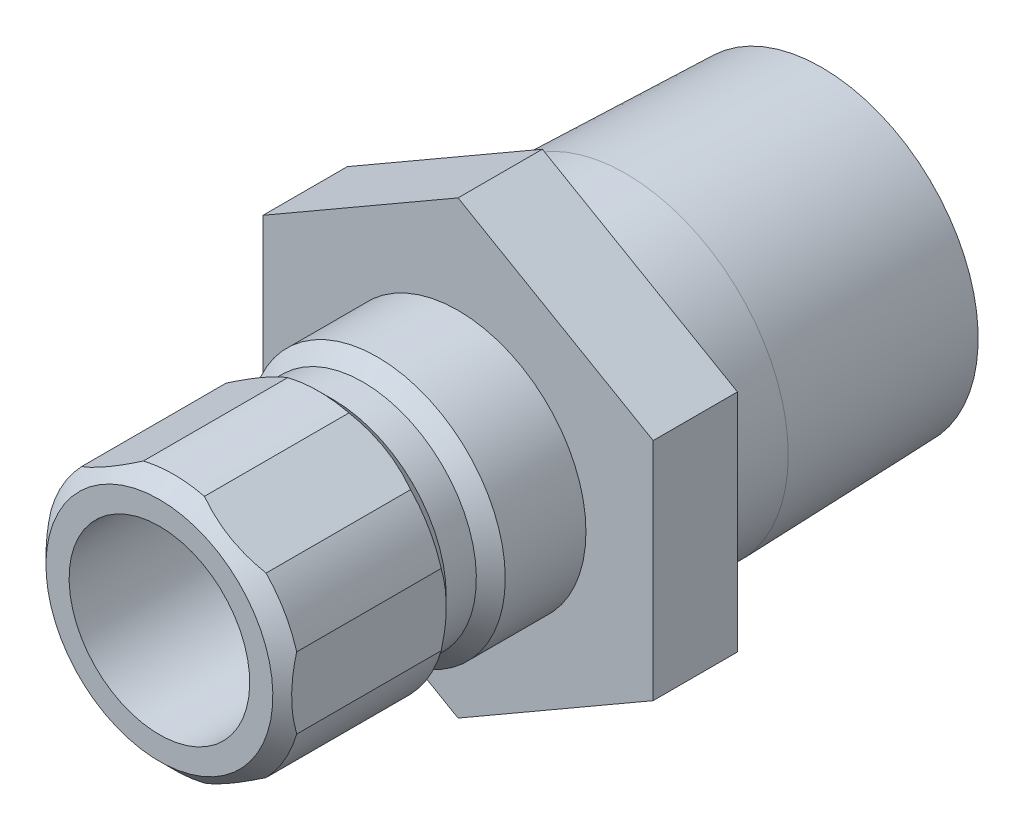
ISO-10303-21;
HEADER;
FILE_DESCRIPTION(('STEP AP214'),'2;1');
FILE_NAME('part.step','',(''),(''),'','','');
FILE_SCHEMA(('AUTOMOTIVE_DESIGN { 1 0 10303 214 1 1 1 1 }'));
ENDSEC;
DATA;
#1=APPLICATION_CONTEXT('core data for automotive mechanical design processes');
#2=APPLICATION_PROTOCOL_DEFINITION('international standard','automotive_design',2000,#1);
#3=PRODUCT_CONTEXT('',#1,'mechanical');
#4=PRODUCT('Part','Part','',(#3));
#5=PRODUCT_RELATED_PRODUCT_CATEGORY('part','',(#4));
#6=PRODUCT_DEFINITION_FORMATION('','',#4);
#7=PRODUCT_DEFINITION_CONTEXT('part definition',#1,'design');
#8=PRODUCT_DEFINITION('design','',#6,#7);
#9=PRODUCT_DEFINITION_SHAPE('','',#8);
#10=(LENGTH_UNIT() NAMED_UNIT(*) SI_UNIT(.MILLI.,.METRE.));
#11=(NAMED_UNIT(*) PLANE_ANGLE_UNIT() SI_UNIT($,.RADIAN.));
#12=(NAMED_UNIT(*) SI_UNIT($,.STERADIAN.) SOLID_ANGLE_UNIT());
#13=UNCERTAINTY_MEASURE_WITH_UNIT(LENGTH_MEASURE(1.E-05),#10,'distance_accuracy_value','');
#14=(GEOMETRIC_REPRESENTATION_CONTEXT(3) GLOBAL_UNCERTAINTY_ASSIGNED_CONTEXT((#13)) GLOBAL_UNIT_ASSIGNED_CONTEXT((#10,
#11,#12)) REPRESENTATION_CONTEXT('',''));
#15=CARTESIAN_POINT('',(0.,0.,0.));
#16=DIRECTION('',(0.,0.,1.));
#17=DIRECTION('',(1.,0.,0.));
#18=AXIS2_PLACEMENT_3D('',#15,#16,#17);
#19=CARTESIAN_POINT('',(0.,0.,0.));
#20=DIRECTION('',(0.,0.,-1.));
#21=DIRECTION('',(0.,1.,0.));
#22=AXIS2_PLACEMENT_3D('',#19,#20,#21);
#23=CYLINDRICAL_SURFACE('',#22,6.7437);
#24=DIRECTION('',(0.,0.,-1.));
#25=VECTOR('',#24,1.);
#26=CARTESIAN_POINT('',(-4.8646828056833,4.67036945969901,0.));
#27=LINE('',#26,#25);
#28=CARTESIAN_POINT('',(-4.86468280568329,4.67036945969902,7.36599999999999));
#29=VERTEX_POINT('',#28);
#30=CARTESIAN_POINT('',(-4.8646828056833,4.67036945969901,14.986));
#31=VERTEX_POINT('',#30);
#32=EDGE_CURVE('E659',#29,#31,#27,.F.);
#33=ORIENTED_EDGE('',*,*,#32,.F.);
#34=CARTESIAN_POINT('',(0.,0.,7.36599999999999));
#35=DIRECTION('',(0.,0.,-1.));
#36=DIRECTION('',(0.,1.,0.));
#37=AXIS2_PLACEMENT_3D('',#34,#35,#36);
#38=CIRCLE('',#37,6.7437);
#39=CARTESIAN_POINT('',(-6.477,1.87775416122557,7.36599999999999));
#40=VERTEX_POINT('',#39);
#41=EDGE_CURVE('E188',#40,#29,#38,.T.);
#42=ORIENTED_EDGE('',*,*,#41,.F.);
#43=DIRECTION('',(0.,0.,-1.));
#44=VECTOR('',#43,1.);
#45=CARTESIAN_POINT('',(-6.477,1.87775416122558,0.));
#46=LINE('',#45,#44);
#47=CARTESIAN_POINT('',(-6.477,1.87775416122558,14.986));
#48=VERTEX_POINT('',#47);
#49=EDGE_CURVE('E61',#48,#40,#46,.T.);
#50=ORIENTED_EDGE('',*,*,#49,.F.);
#51=CARTESIAN_POINT('',(0.,0.,14.986));
#52=DIRECTION('',(0.,0.,-1.));
#53=DIRECTION('',(0.,1.,0.));
#54=AXIS2_PLACEMENT_3D('',#51,#52,#53);
#55=CIRCLE('',#54,6.7437);
#56=EDGE_CURVE('E199',#48,#31,#55,.T.);
#57=ORIENTED_EDGE('',*,*,#56,.T.);
#58=EDGE_LOOP('',(#33,#42,#50,#57));
#59=FACE_BOUND('',#58,.T.);
#60=ADVANCED_FACE('F34',(#59),#23,.T.);
#61=DIRECTION('',(0.,0.,-1.));
#62=VECTOR('',#61,1.);
#63=CARTESIAN_POINT('',(-6.477,-1.87775416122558,0.));
#64=LINE('',#63,#62);
#65=CARTESIAN_POINT('',(-6.477,-1.87775416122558,7.36599999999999));
#66=VERTEX_POINT('',#65);
#67=CARTESIAN_POINT('',(-6.477,-1.87775416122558,14.986));
#68=VERTEX_POINT('',#67);
#69=EDGE_CURVE('E219',#66,#68,#64,.F.);
#70=ORIENTED_EDGE('',*,*,#69,.F.);
#71=CARTESIAN_POINT('',(-4.86468280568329,-4.67036945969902,7.36599999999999));
#72=VERTEX_POINT('',#71);
#73=EDGE_CURVE('E192',#72,#66,#38,.T.);
#74=ORIENTED_EDGE('',*,*,#73,.F.);
#75=DIRECTION('',(0.,0.,-1.));
#76=VECTOR('',#75,1.);
#77=CARTESIAN_POINT('',(-4.86468280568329,-4.67036945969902,0.));
#78=LINE('',#77,#76);
#79=CARTESIAN_POINT('',(-4.86468280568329,-4.67036945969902,14.986));
#80=VERTEX_POINT('',#79);
#81=EDGE_CURVE('E217',#80,#72,#78,.T.);
#82=ORIENTED_EDGE('',*,*,#81,.F.);
#83=EDGE_CURVE('E220',#80,#68,#55,.T.);
#84=ORIENTED_EDGE('',*,*,#83,.T.);
#85=EDGE_LOOP('',(#70,#74,#82,#84));
#86=FACE_BOUND('',#85,.T.);
#87=ADVANCED_FACE('F215',(#86),#23,.T.);
#88=DIRECTION('',(0.,0.,-1.));
#89=VECTOR('',#88,1.);
#90=CARTESIAN_POINT('',(-1.61231719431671,-6.5481236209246,0.));
#91=LINE('',#90,#89);
#92=CARTESIAN_POINT('',(-1.61231719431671,-6.5481236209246,7.36599999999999));
#93=VERTEX_POINT('',#92);
#94=CARTESIAN_POINT('',(-1.61231719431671,-6.5481236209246,14.986));
#95=VERTEX_POINT('',#94);
#96=EDGE_CURVE('E298',#93,#95,#91,.F.);
#97=ORIENTED_EDGE('',*,*,#96,.F.);
#98=CARTESIAN_POINT('',(1.61231719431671,-6.5481236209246,7.36599999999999));
#99=VERTEX_POINT('',#98);
#100=EDGE_CURVE('E202',#99,#93,#38,.T.);
#101=ORIENTED_EDGE('',*,*,#100,.F.);
#102=DIRECTION('',(0.,0.,-1.));
#103=VECTOR('',#102,1.);
#104=CARTESIAN_POINT('',(1.61231719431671,-6.5481236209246,0.));
#105=LINE('',#104,#103);
#106=CARTESIAN_POINT('',(1.61231719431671,-6.5481236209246,14.986));
#107=VERTEX_POINT('',#106);
#108=EDGE_CURVE('E315',#107,#99,#105,.T.);
#109=ORIENTED_EDGE('',*,*,#108,.F.);
#110=EDGE_CURVE('E311',#107,#95,#55,.T.);
#111=ORIENTED_EDGE('',*,*,#110,.T.);
#112=EDGE_LOOP('',(#97,#101,#109,#111));
#113=FACE_BOUND('',#112,.T.);
#114=ADVANCED_FACE('F314',(#113),#23,.T.);
#115=DIRECTION('',(0.,0.,-1.));
#116=VECTOR('',#115,1.);
#117=CARTESIAN_POINT('',(4.8646828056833,-4.67036945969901,0.));
#118=LINE('',#117,#116);
#119=CARTESIAN_POINT('',(4.8646828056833,-4.67036945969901,7.36599999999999));
#120=VERTEX_POINT('',#119);
#121=CARTESIAN_POINT('',(4.8646828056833,-4.67036945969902,14.986));
#122=VERTEX_POINT('',#121);
#123=EDGE_CURVE('E295',#120,#122,#118,.F.);
#124=ORIENTED_EDGE('',*,*,#123,.F.);
#125=CARTESIAN_POINT('',(6.477,-1.87775416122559,7.36599999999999));
#126=VERTEX_POINT('',#125);
#127=EDGE_CURVE('E197',#126,#120,#38,.T.);
#128=ORIENTED_EDGE('',*,*,#127,.F.);
#129=DIRECTION('',(0.,0.,-1.));
#130=VECTOR('',#129,1.);
#131=CARTESIAN_POINT('',(6.477,-1.87775416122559,0.));
#132=LINE('',#131,#130);
#133=CARTESIAN_POINT('',(6.477,-1.8777541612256,14.986));
#134=VERTEX_POINT('',#133);
#135=EDGE_CURVE('E406',#134,#126,#132,.T.);
#136=ORIENTED_EDGE('',*,*,#135,.F.);
#137=EDGE_CURVE('E316',#134,#122,#55,.T.);
#138=ORIENTED_EDGE('',*,*,#137,.T.);
#139=EDGE_LOOP('',(#124,#128,#136,#138));
#140=FACE_BOUND('',#139,.T.);
#141=ADVANCED_FACE('F391',(#140),#23,.T.);
#142=DIRECTION('',(0.,0.,-1.));
#143=VECTOR('',#142,1.);
#144=CARTESIAN_POINT('',(6.477,1.87775416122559,0.));
#145=LINE('',#144,#143);
#146=CARTESIAN_POINT('',(6.477,1.87775416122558,7.36599999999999));
#147=VERTEX_POINT('',#146);
#148=CARTESIAN_POINT('',(6.477,1.87775416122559,14.986));
#149=VERTEX_POINT('',#148);
#150=EDGE_CURVE('E401',#147,#149,#145,.F.);
#151=ORIENTED_EDGE('',*,*,#150,.F.);
#152=CARTESIAN_POINT('',(4.86468280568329,4.67036945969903,7.36599999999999));
#153=VERTEX_POINT('',#152);
#154=EDGE_CURVE('E191',#153,#147,#38,.T.);
#155=ORIENTED_EDGE('',*,*,#154,.F.);
#156=DIRECTION('',(0.,0.,-1.));
#157=VECTOR('',#156,1.);
#158=CARTESIAN_POINT('',(4.86468280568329,4.67036945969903,0.));
#159=LINE('',#158,#157);
#160=CARTESIAN_POINT('',(4.86468280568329,4.67036945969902,14.986));
#161=VERTEX_POINT('',#160);
#162=EDGE_CURVE('E168',#161,#153,#159,.T.);
#163=ORIENTED_EDGE('',*,*,#162,.F.);
#164=EDGE_CURVE('E200',#161,#149,#55,.T.);
#165=ORIENTED_EDGE('',*,*,#164,.T.);
#166=EDGE_LOOP('',(#151,#155,#163,#165));
#167=FACE_BOUND('',#166,.T.);
#168=ADVANCED_FACE('F385',(#167),#23,.T.);
#169=CARTESIAN_POINT('',(0.,0.,0.));
#170=DIRECTION('',(0.,0.,-1.));
#171=DIRECTION('',(0.,1.,0.));
#172=AXIS2_PLACEMENT_3D('',#169,#170,#171);
#173=CYLINDRICAL_SURFACE('',#172,4.7625);
#174=CARTESIAN_POINT('',(0.,0.,15.748));
#175=DIRECTION('',(0.,0.,-1.));
#176=DIRECTION('',(0.,1.,0.));
#177=AXIS2_PLACEMENT_3D('',#174,#175,#176);
#178=CIRCLE('',#177,4.7625);
#179=CARTESIAN_POINT('',(0.,4.7625,15.748));
#180=VERTEX_POINT('',#179);
#181=EDGE_CURVE('E174',#180,#180,#178,.T.);
#182=ORIENTED_EDGE('',*,*,#181,.F.);
#183=EDGE_LOOP('',(#182));
#184=FACE_BOUND('',#183,.T.);
#185=CARTESIAN_POINT('',(0.,0.,-4.445));
#186=DIRECTION('',(0.,0.,1.));
#187=DIRECTION('',(1.,0.,0.));
#188=AXIS2_PLACEMENT_3D('',#185,#186,#187);
#189=CIRCLE('',#188,4.7625);
#190=CARTESIAN_POINT('',(4.7625,0.,-4.445));
#191=VERTEX_POINT('',#190);
#192=EDGE_CURVE('E483',#191,#191,#189,.T.);
#193=ORIENTED_EDGE('',*,*,#192,.F.);
#194=EDGE_LOOP('',(#193));
#195=FACE_BOUND('',#194,.T.);
#196=ADVANCED_FACE('F36',(#184,#195),#173,.F.);
#197=CARTESIAN_POINT('',(0.,4.7625,15.748));
#198=DIRECTION('',(0.,0.,1.));
#199=DIRECTION('',(0.,-1.,0.));
#200=AXIS2_PLACEMENT_3D('',#197,#198,#199);
#201=PLANE('',#200);
#202=ORIENTED_EDGE('',*,*,#181,.T.);
#203=EDGE_LOOP('',(#202));
#204=FACE_BOUND('',#203,.T.);
#205=CARTESIAN_POINT('',(0.,0.,15.748));
#206=DIRECTION('',(0.,0.,-1.));
#207=DIRECTION('',(0.,1.,0.));
#208=AXIS2_PLACEMENT_3D('',#205,#206,#207);
#209=CIRCLE('',#208,5.9817);
#210=CARTESIAN_POINT('',(0.,5.9817,15.748));
#211=VERTEX_POINT('',#210);
#212=EDGE_CURVE('E319',#211,#211,#209,.T.);
#213=ORIENTED_EDGE('',*,*,#212,.F.);
#214=EDGE_LOOP('',(#213));
#215=FACE_BOUND('',#214,.T.);
#216=ADVANCED_FACE('F389',(#204,#215),#201,.T.);
#217=CARTESIAN_POINT('',(0.,0.,14.986));
#218=DIRECTION('',(0.,0.,-1.));
#219=DIRECTION('',(0.,1.,0.));
#220=AXIS2_PLACEMENT_3D('',#217,#218,#219);
#221=CONICAL_SURFACE('',#220,6.7437,0.785398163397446);
#222=CARTESIAN_POINT('',(-4.86530473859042,4.67001038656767,14.9858));
#223=CARTESIAN_POINT('',(-4.72486305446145,4.75109443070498,15.0310202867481));
#224=CARTESIAN_POINT('',(-4.58312979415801,4.83292416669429,15.0711660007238));
#225=CARTESIAN_POINT('',(-4.29751110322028,4.99782619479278,15.1402365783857));
#226=CARTESIAN_POINT('',(-4.1536239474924,5.0808994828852,15.1691518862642));
#227=CARTESIAN_POINT('',(-3.86733938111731,5.2461859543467,15.2141425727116));
#228=CARTESIAN_POINT('',(-3.72497207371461,5.32838175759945,15.2304694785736));
#229=CARTESIAN_POINT('',(-3.43963286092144,5.49312242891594,15.2506210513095));
#230=CARTESIAN_POINT('',(-3.29666126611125,5.57566711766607,15.2544515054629));
#231=CARTESIAN_POINT('',(-3.02472390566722,5.73267022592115,15.2497120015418));
#232=CARTESIAN_POINT('',(-2.89574173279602,5.807138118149,15.2423062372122));
#233=CARTESIAN_POINT('',(-2.63846984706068,5.95567411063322,15.2174303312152));
#234=CARTESIAN_POINT('',(-2.51018036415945,6.02974207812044,15.1999570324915));
#235=CARTESIAN_POINT('',(-2.25244237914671,6.17854717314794,15.1550584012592));
#236=CARTESIAN_POINT('',(-2.1230180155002,6.25327036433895,15.1274506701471));
#237=CARTESIAN_POINT('',(-1.86594955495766,6.40168890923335,15.0631944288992));
#238=CARTESIAN_POINT('',(-1.73830430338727,6.47538492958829,15.026552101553));
#239=CARTESIAN_POINT('',(-1.61169526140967,6.5484826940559,14.9858));
#240=B_SPLINE_CURVE_WITH_KNOTS('',3,(#222,#223,#224,#225,#226,#227,#228,#229,#230,#231,#232,
#233,#234,#235,#236,#237,#238,#239),.UNSPECIFIED.,.F.,.F.,(4,2,2,2,2,2,2,2,4),(0.,
0.505093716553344,1.01061627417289,1.50575564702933,2.00066568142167,2.4476800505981,
2.89483467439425,3.35046683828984,3.80578805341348),.UNSPECIFIED.);
#241=CARTESIAN_POINT('',(-1.61231719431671,6.5481236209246,14.986));
#242=VERTEX_POINT('',#241);
#243=EDGE_CURVE('E488',#31,#242,#240,.T.);
#244=ORIENTED_EDGE('',*,*,#243,.F.);
#245=ORIENTED_EDGE('',*,*,#56,.F.);
#246=CARTESIAN_POINT('',(-6.477,-7.31595245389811,11.9585849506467));
#247=CARTESIAN_POINT('',(-6.477,-7.1371619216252,12.09242068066));
#248=CARTESIAN_POINT('',(-6.477,-6.95735466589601,12.2249205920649));
#249=CARTESIAN_POINT('',(-6.477,-6.59531185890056,12.4866559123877));
#250=CARTESIAN_POINT('',(-6.477,-6.41307569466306,12.6158904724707));
#251=CARTESIAN_POINT('',(-6.477,-6.04444818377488,12.8714195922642));
#252=CARTESIAN_POINT('',(-6.477,-5.85803557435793,12.9976835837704));
#253=CARTESIAN_POINT('',(-6.477,-5.48202253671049,13.245356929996));
#254=CARTESIAN_POINT('',(-6.477,-5.29242233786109,13.3667666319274));
#255=CARTESIAN_POINT('',(-6.477,-4.8990824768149,13.6101330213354));
#256=CARTESIAN_POINT('',(-6.477,-4.69513615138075,13.7317573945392));
#257=CARTESIAN_POINT('',(-6.477,-4.2824994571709,13.9668032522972));
#258=CARTESIAN_POINT('',(-6.477,-4.07380836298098,14.0802234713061));
#259=CARTESIAN_POINT('',(-6.477,-3.65173370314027,14.2964010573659));
#260=CARTESIAN_POINT('',(-6.477,-3.43836632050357,14.3991897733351));
#261=CARTESIAN_POINT('',(-6.477,-3.00590599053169,14.59180459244));
#262=CARTESIAN_POINT('',(-6.477,-2.78681563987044,14.6816364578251));
#263=CARTESIAN_POINT('',(-6.477,-2.35869152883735,14.8392509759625));
#264=CARTESIAN_POINT('',(-6.477,-2.15007621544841,14.9081583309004));
#265=CARTESIAN_POINT('',(-6.477,-1.72794730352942,15.029215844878));
#266=CARTESIAN_POINT('',(-6.477,-1.51443335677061,15.0813648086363));
#267=CARTESIAN_POINT('',(-6.477,-1.08726616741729,15.1653541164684));
#268=CARTESIAN_POINT('',(-6.477,-0.873680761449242,15.1975339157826));
#269=CARTESIAN_POINT('',(-6.477,-0.444382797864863,15.2409825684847));
#270=CARTESIAN_POINT('',(-6.477,-0.228670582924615,15.2522547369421));
#271=CARTESIAN_POINT('',(-6.477,0.195590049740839,15.2531049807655));
#272=CARTESIAN_POINT('',(-6.477,0.40413733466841,15.2433943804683));
#273=CARTESIAN_POINT('',(-6.477,0.819375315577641,15.2043531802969));
#274=CARTESIAN_POINT('',(-6.477,1.026065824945,15.1750206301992));
#275=CARTESIAN_POINT('',(-6.477,1.43958683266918,15.0978125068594));
#276=CARTESIAN_POINT('',(-6.477,1.64635839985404,15.0496261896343));
#277=CARTESIAN_POINT('',(-6.477,2.05541277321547,14.9372378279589));
#278=CARTESIAN_POINT('',(-6.477,2.25769600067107,14.8730372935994));
#279=CARTESIAN_POINT('',(-6.477,2.67942290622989,14.7234325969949));
#280=CARTESIAN_POINT('',(-6.477,2.89830973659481,14.6364736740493));
#281=CARTESIAN_POINT('',(-6.477,3.33036785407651,14.4492510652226));
#282=CARTESIAN_POINT('',(-6.477,3.5435363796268,14.3489810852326));
#283=CARTESIAN_POINT('',(-6.477,3.96521765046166,14.1375266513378));
#284=CARTESIAN_POINT('',(-6.477,4.17371291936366,14.026307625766));
#285=CARTESIAN_POINT('',(-6.477,4.58589470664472,13.7954185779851));
#286=CARTESIAN_POINT('',(-6.477,4.78958199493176,13.6757499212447));
#287=CARTESIAN_POINT('',(-6.477,5.18271200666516,13.4357848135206));
#288=CARTESIAN_POINT('',(-6.477,5.37235766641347,13.3158190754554));
#289=CARTESIAN_POINT('',(-6.477,5.74839484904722,13.0708760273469));
#290=CARTESIAN_POINT('',(-6.477,5.93478612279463,12.9458983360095));
#291=CARTESIAN_POINT('',(-6.477,6.30322303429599,12.6928680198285));
#292=CARTESIAN_POINT('',(-6.477,6.48529173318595,12.5648488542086));
#293=CARTESIAN_POINT('',(-6.477,6.84694630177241,12.3054498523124));
#294=CARTESIAN_POINT('',(-6.477,7.02653283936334,12.174070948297));
#295=CARTESIAN_POINT('',(-6.477,7.20508094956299,12.041319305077));
#296=B_SPLINE_CURVE_WITH_KNOTS('',3,(#246,#247,#248,#249,#250,#251,#252,#253,#254,#255,#256,
#257,#258,#259,#260,#261,#262,#263,#264,#265,#266,#267,#268,#269,#270,#271,#272,#273,#274,#275,
#276,#277,#278,#279,#280,#281,#282,#283,#284,#285,#286,#287,#288,#289,#290,#291,#292,#293,#294,
#295),.UNSPECIFIED.,.F.,.F.,(4,2,2,2,2,2,2,2,2,2,2,2,2,2,2,2,2,2,2,2,2,2,2,2,4),(0.,
0.670015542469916,1.34020350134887,2.01558827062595,2.69092464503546,3.40314702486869,
4.11547903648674,4.82564684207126,5.53549783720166,6.19401709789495,6.85258331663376,
7.49962373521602,8.14656155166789,8.77191276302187,9.39732613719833,10.0335138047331,
10.6696415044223,11.3756703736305,12.0820342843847,12.7907048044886,13.4992610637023,
14.1723809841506,14.845552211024,15.5132243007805,16.1807130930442),.UNSPECIFIED.);
#297=EDGE_CURVE('E222',#68,#48,#296,.T.);
#298=ORIENTED_EDGE('',*,*,#297,.F.);
#299=ORIENTED_EDGE('',*,*,#83,.F.);
#300=CARTESIAN_POINT('',(-1.61169526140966,-6.5484826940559,14.9858));
#301=CARTESIAN_POINT('',(-1.75213694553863,-6.4673986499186,15.0310202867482));
#302=CARTESIAN_POINT('',(-1.89387020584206,-6.38556891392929,15.0711660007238));
#303=CARTESIAN_POINT('',(-2.1794888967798,-6.2206668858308,15.1402365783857));
#304=CARTESIAN_POINT('',(-2.32337605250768,-6.13759359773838,15.1691518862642));
#305=CARTESIAN_POINT('',(-2.60966061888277,-5.97230712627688,15.2141425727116));
#306=CARTESIAN_POINT('',(-2.75202792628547,-5.89011132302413,15.2304694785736));
#307=CARTESIAN_POINT('',(-3.03736713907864,-5.72537065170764,15.2506210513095));
#308=CARTESIAN_POINT('',(-3.18033873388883,-5.64282596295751,15.2544515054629));
#309=CARTESIAN_POINT('',(-3.45227609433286,-5.48582285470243,15.2497120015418));
#310=CARTESIAN_POINT('',(-3.58125826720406,-5.41135496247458,15.2423062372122));
#311=CARTESIAN_POINT('',(-3.83853015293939,-5.26281896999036,15.2174303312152));
#312=CARTESIAN_POINT('',(-3.96681963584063,-5.18875100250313,15.1999570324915));
#313=CARTESIAN_POINT('',(-4.22455762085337,-5.03994590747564,15.1550584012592));
#314=CARTESIAN_POINT('',(-4.35398198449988,-4.96522271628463,15.1274506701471));
#315=CARTESIAN_POINT('',(-4.61105044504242,-4.81680417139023,15.0631944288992));
#316=CARTESIAN_POINT('',(-4.73869569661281,-4.74310815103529,15.026552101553));
#317=CARTESIAN_POINT('',(-4.86530473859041,-4.67001038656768,14.9858));
#318=B_SPLINE_CURVE_WITH_KNOTS('',3,(#300,#301,#302,#303,#304,#305,#306,#307,#308,#309,#310,
#311,#312,#313,#314,#315,#316,#317),.UNSPECIFIED.,.F.,.F.,(4,2,2,2,2,2,2,2,4),(0.,
0.505093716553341,1.01061627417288,1.50575564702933,2.00066568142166,2.44768005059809,
2.89483467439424,3.35046683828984,3.80578805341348),.UNSPECIFIED.);
#319=EDGE_CURVE('E225',#95,#80,#318,.T.);
#320=ORIENTED_EDGE('',*,*,#319,.F.);
#321=ORIENTED_EDGE('',*,*,#110,.F.);
#322=CARTESIAN_POINT('',(4.86530473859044,-4.67001038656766,14.9858));
#323=CARTESIAN_POINT('',(4.72486305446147,-4.75109443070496,15.0310202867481));
#324=CARTESIAN_POINT('',(4.58312979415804,-4.83292416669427,15.0711660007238));
#325=CARTESIAN_POINT('',(4.2975111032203,-4.99782619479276,15.1402365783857));
#326=CARTESIAN_POINT('',(4.15362394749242,-5.08089948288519,15.1691518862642));
#327=CARTESIAN_POINT('',(3.86733938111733,-5.24618595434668,15.2141425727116));
#328=CARTESIAN_POINT('',(3.72497207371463,-5.32838175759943,15.2304694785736));
#329=CARTESIAN_POINT('',(3.43963286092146,-5.49312242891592,15.2506210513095));
#330=CARTESIAN_POINT('',(3.29666126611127,-5.57566711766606,15.2544515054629));
#331=CARTESIAN_POINT('',(3.02472390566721,-5.73267022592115,15.2497120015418));
#332=CARTESIAN_POINT('',(2.89574173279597,-5.80713811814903,15.2423062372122));
#333=CARTESIAN_POINT('',(2.63846984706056,-5.95567411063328,15.2174303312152));
#334=CARTESIAN_POINT('',(2.51018036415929,-6.02974207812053,15.1999570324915));
#335=CARTESIAN_POINT('',(2.25244237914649,-6.17854717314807,15.1550584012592));
#336=CARTESIAN_POINT('',(2.12301801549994,-6.2532703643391,15.127450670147));
#337=CARTESIAN_POINT('',(1.86594955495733,-6.40168890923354,15.0631944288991));
#338=CARTESIAN_POINT('',(1.73830430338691,-6.4753849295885,15.0265521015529));
#339=CARTESIAN_POINT('',(1.61169526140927,-6.54848269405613,14.9857999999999));
#340=B_SPLINE_CURVE_WITH_KNOTS('',3,(#322,#323,#324,#325,#326,#327,#328,#329,#330,#331,#332,
#333,#334,#335,#336,#337,#338,#339),.UNSPECIFIED.,.F.,.F.,(4,2,2,2,2,2,2,2,4),(0.,
0.505093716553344,1.01061627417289,1.50575564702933,2.00066568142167,2.44768005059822,
2.8948346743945,3.35046683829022,3.80578805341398),.UNSPECIFIED.);
#341=EDGE_CURVE('E289',#122,#107,#340,.T.);
#342=ORIENTED_EDGE('',*,*,#341,.F.);
#343=ORIENTED_EDGE('',*,*,#137,.F.);
#344=CARTESIAN_POINT('',(6.47699999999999,-7.31595245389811,11.9585849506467));
#345=CARTESIAN_POINT('',(6.47699999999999,-7.1371619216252,12.09242068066));
#346=CARTESIAN_POINT('',(6.47699999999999,-6.957354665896,12.2249205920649));
#347=CARTESIAN_POINT('',(6.47699999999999,-6.59531185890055,12.4866559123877));
#348=CARTESIAN_POINT('',(6.477,-6.41307569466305,12.6158904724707));
#349=CARTESIAN_POINT('',(6.477,-6.04444818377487,12.8714195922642));
#350=CARTESIAN_POINT('',(6.477,-5.85803557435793,12.9976835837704));
#351=CARTESIAN_POINT('',(6.477,-5.48202253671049,13.245356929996));
#352=CARTESIAN_POINT('',(6.477,-5.29242233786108,13.3667666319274));
#353=CARTESIAN_POINT('',(6.477,-4.8990824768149,13.6101330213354));
#354=CARTESIAN_POINT('',(6.477,-4.69513615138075,13.7317573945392));
#355=CARTESIAN_POINT('',(6.477,-4.28249945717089,13.9668032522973));
#356=CARTESIAN_POINT('',(6.477,-4.07380836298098,14.0802234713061));
#357=CARTESIAN_POINT('',(6.477,-3.65173370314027,14.2964010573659));
#358=CARTESIAN_POINT('',(6.477,-3.43836632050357,14.3991897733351));
#359=CARTESIAN_POINT('',(6.477,-3.00590599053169,14.59180459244));
#360=CARTESIAN_POINT('',(6.477,-2.78681563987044,14.6816364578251));
#361=CARTESIAN_POINT('',(6.477,-2.35869152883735,14.8392509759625));
#362=CARTESIAN_POINT('',(6.477,-2.15007621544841,14.9081583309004));
#363=CARTESIAN_POINT('',(6.477,-1.72794730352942,15.029215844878));
#364=CARTESIAN_POINT('',(6.477,-1.51443335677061,15.0813648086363));
#365=CARTESIAN_POINT('',(6.477,-1.08726616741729,15.1653541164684));
#366=CARTESIAN_POINT('',(6.477,-0.873680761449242,15.1975339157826));
#367=CARTESIAN_POINT('',(6.477,-0.444382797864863,15.2409825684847));
#368=CARTESIAN_POINT('',(6.477,-0.228670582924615,15.2522547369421));
#369=CARTESIAN_POINT('',(6.477,0.195590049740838,15.2531049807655));
#370=CARTESIAN_POINT('',(6.477,0.404137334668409,15.2433943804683));
#371=CARTESIAN_POINT('',(6.477,0.81937531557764,15.2043531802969));
#372=CARTESIAN_POINT('',(6.477,1.026065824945,15.1750206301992));
#373=CARTESIAN_POINT('',(6.477,1.43958683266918,15.0978125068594));
#374=CARTESIAN_POINT('',(6.477,1.64635839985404,15.0496261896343));
#375=CARTESIAN_POINT('',(6.477,2.05541277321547,14.937237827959));
#376=CARTESIAN_POINT('',(6.477,2.25769600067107,14.8730372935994));
#377=CARTESIAN_POINT('',(6.477,2.67942290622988,14.7234325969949));
#378=CARTESIAN_POINT('',(6.477,2.8983097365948,14.6364736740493));
#379=CARTESIAN_POINT('',(6.477,3.33036785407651,14.4492510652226));
#380=CARTESIAN_POINT('',(6.477,3.5435363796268,14.3489810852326));
#381=CARTESIAN_POINT('',(6.477,3.96521765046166,14.1375266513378));
#382=CARTESIAN_POINT('',(6.477,4.17371291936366,14.026307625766));
#383=CARTESIAN_POINT('',(6.477,4.58589470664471,13.7954185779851));
#384=CARTESIAN_POINT('',(6.477,4.78958199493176,13.6757499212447));
#385=CARTESIAN_POINT('',(6.477,5.18271200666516,13.4357848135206));
#386=CARTESIAN_POINT('',(6.477,5.37235766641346,13.3158190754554));
#387=CARTESIAN_POINT('',(6.477,5.74839484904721,13.0708760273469));
#388=CARTESIAN_POINT('',(6.477,5.93478612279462,12.9458983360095));
#389=CARTESIAN_POINT('',(6.477,6.30322303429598,12.6928680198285));
#390=CARTESIAN_POINT('',(6.477,6.48529173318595,12.5648488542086));
#391=CARTESIAN_POINT('',(6.477,6.84694630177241,12.3054498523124));
#392=CARTESIAN_POINT('',(6.477,7.02653283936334,12.174070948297));
#393=CARTESIAN_POINT('',(6.477,7.20508094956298,12.041319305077));
#394=B_SPLINE_CURVE_WITH_KNOTS('',3,(#344,#345,#346,#347,#348,#349,#350,#351,#352,#353,#354,
#355,#356,#357,#358,#359,#360,#361,#362,#363,#364,#365,#366,#367,#368,#369,#370,#371,#372,#373,
#374,#375,#376,#377,#378,#379,#380,#381,#382,#383,#384,#385,#386,#387,#388,#389,#390,#391,#392,
#393),.UNSPECIFIED.,.F.,.F.,(4,2,2,2,2,2,2,2,2,2,2,2,2,2,2,2,2,2,2,2,2,2,2,2,4),(0.,
0.670015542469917,1.34020350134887,2.01558827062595,2.69092464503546,3.40314702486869,
4.11547903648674,4.82564684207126,5.53549783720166,6.19401709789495,6.85258331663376,
7.49962373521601,8.14656155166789,8.77191276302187,9.39732613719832,10.0335138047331,
10.6696415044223,11.3756703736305,12.0820342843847,12.7907048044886,13.4992610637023,
14.1723809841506,14.845552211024,15.5132243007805,16.1807130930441),.UNSPECIFIED.);
#395=EDGE_CURVE('E405',#149,#134,#394,.F.);
#396=ORIENTED_EDGE('',*,*,#395,.F.);
#397=ORIENTED_EDGE('',*,*,#164,.F.);
#398=CARTESIAN_POINT('',(1.61169526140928,6.54848269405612,14.9857999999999));
#399=CARTESIAN_POINT('',(1.75213694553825,6.46739864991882,15.031020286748));
#400=CARTESIAN_POINT('',(1.89387020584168,6.38556891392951,15.0711660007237));
#401=CARTESIAN_POINT('',(2.17948889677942,6.22066688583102,15.1402365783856));
#402=CARTESIAN_POINT('',(2.3233760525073,6.1375935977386,15.1691518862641));
#403=CARTESIAN_POINT('',(2.60966061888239,5.9723071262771,15.2141425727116));
#404=CARTESIAN_POINT('',(2.75202792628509,5.89011132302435,15.2304694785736));
#405=CARTESIAN_POINT('',(3.03736713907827,5.72537065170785,15.2506210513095));
#406=CARTESIAN_POINT('',(3.18033873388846,5.64282596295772,15.2544515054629));
#407=CARTESIAN_POINT('',(3.45227609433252,5.48582285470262,15.2497120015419));
#408=CARTESIAN_POINT('',(3.58125826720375,5.41135496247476,15.2423062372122));
#409=CARTESIAN_POINT('',(3.83853015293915,5.2628189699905,15.2174303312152));
#410=CARTESIAN_POINT('',(3.96681963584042,5.18875100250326,15.1999570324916));
#411=CARTESIAN_POINT('',(4.22455762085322,5.03994590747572,15.1550584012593));
#412=CARTESIAN_POINT('',(4.35398198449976,4.9652227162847,15.1274506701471));
#413=CARTESIAN_POINT('',(4.61105044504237,4.81680417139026,15.0631944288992));
#414=CARTESIAN_POINT('',(4.73869569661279,4.7431081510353,15.026552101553));
#415=CARTESIAN_POINT('',(4.86530473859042,4.67001038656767,14.9858));
#416=B_SPLINE_CURVE_WITH_KNOTS('',3,(#398,#399,#400,#401,#402,#403,#404,#405,#406,#407,#408,
#409,#410,#411,#412,#413,#414,#415),.UNSPECIFIED.,.F.,.F.,(4,2,2,2,2,2,2,2,4),(0.,
0.505093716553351,1.0106162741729,1.50575564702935,2.0006656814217,2.44768005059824,
2.89483467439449,3.3504668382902,3.80578805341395),.UNSPECIFIED.);
#417=CARTESIAN_POINT('',(1.61231719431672,6.5481236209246,14.986));
#418=VERTEX_POINT('',#417);
#419=EDGE_CURVE('E183',#418,#161,#416,.T.);
#420=ORIENTED_EDGE('',*,*,#419,.F.);
#421=EDGE_CURVE('E182',#242,#418,#55,.T.);
#422=ORIENTED_EDGE('',*,*,#421,.F.);
#423=EDGE_LOOP('',(#244,#245,#298,#299,#320,#321,#342,#343,#396,#397,#420,#422));
#424=FACE_BOUND('',#423,.T.);
#425=ORIENTED_EDGE('',*,*,#212,.T.);
#426=EDGE_LOOP('',(#425));
#427=FACE_BOUND('',#426,.T.);
#428=ADVANCED_FACE('F235',(#424,#427),#221,.T.);
#429=DIRECTION('',(0.,0.,-1.));
#430=VECTOR('',#429,1.);
#431=CARTESIAN_POINT('',(-1.61231719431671,6.5481236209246,0.));
#432=LINE('',#431,#430);
#433=CARTESIAN_POINT('',(-1.61231719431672,6.5481236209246,7.36599999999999));
#434=VERTEX_POINT('',#433);
#435=EDGE_CURVE('E53',#242,#434,#432,.T.);
#436=ORIENTED_EDGE('',*,*,#435,.F.);
#437=ORIENTED_EDGE('',*,*,#421,.T.);
#438=DIRECTION('',(0.,0.,-1.));
#439=VECTOR('',#438,1.);
#440=CARTESIAN_POINT('',(1.61231719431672,6.5481236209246,0.));
#441=LINE('',#440,#439);
#442=CARTESIAN_POINT('',(1.61231719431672,6.5481236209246,7.36599999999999));
#443=VERTEX_POINT('',#442);
#444=EDGE_CURVE('E165',#443,#418,#441,.F.);
#445=ORIENTED_EDGE('',*,*,#444,.F.);
#446=EDGE_CURVE('E180',#434,#443,#38,.T.);
#447=ORIENTED_EDGE('',*,*,#446,.F.);
#448=EDGE_LOOP('',(#436,#437,#445,#447));
#449=FACE_BOUND('',#448,.T.);
#450=ADVANCED_FACE('F179',(#449),#23,.T.);
#451=CARTESIAN_POINT('',(0.,0.,6.604));
#452=DIRECTION('',(0.,0.,1.));
#453=DIRECTION('',(0.,-1.,0.));
#454=AXIS2_PLACEMENT_3D('',#451,#452,#453);
#455=CONICAL_SURFACE('',#454,5.9817,0.785398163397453);
#456=CARTESIAN_POINT('',(-1.61169526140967,6.5484826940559,7.36619999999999));
#457=CARTESIAN_POINT('',(-1.75213694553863,6.46739864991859,7.32097971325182));
#458=CARTESIAN_POINT('',(-1.89387020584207,6.38556891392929,7.2808339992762));
#459=CARTESIAN_POINT('',(-2.1794888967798,6.2206668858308,7.21176342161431));
#460=CARTESIAN_POINT('',(-2.32337605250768,6.13759359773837,7.18284811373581));
#461=CARTESIAN_POINT('',(-2.60966061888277,5.97230712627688,7.13785742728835));
#462=CARTESIAN_POINT('',(-2.75202792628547,5.89011132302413,7.12153052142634));
#463=CARTESIAN_POINT('',(-3.03736713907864,5.72537065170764,7.10137894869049));
#464=CARTESIAN_POINT('',(-3.18033873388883,5.64282596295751,7.09754849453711));
#465=CARTESIAN_POINT('',(-3.45227609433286,5.48582285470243,7.10228799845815));
#466=CARTESIAN_POINT('',(-3.58125826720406,5.41135496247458,7.10969376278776));
#467=CARTESIAN_POINT('',(-3.83853015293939,5.26281896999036,7.13456966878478));
#468=CARTESIAN_POINT('',(-3.96681963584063,5.18875100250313,7.15204296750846));
#469=CARTESIAN_POINT('',(-4.22455762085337,5.03994590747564,7.19694159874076));
#470=CARTESIAN_POINT('',(-4.35398198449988,4.96522271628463,7.22454932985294));
#471=CARTESIAN_POINT('',(-4.61105044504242,4.81680417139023,7.2888055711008));
#472=CARTESIAN_POINT('',(-4.73869569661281,4.74310815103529,7.32544789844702));
#473=CARTESIAN_POINT('',(-4.86530473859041,4.67001038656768,7.36620000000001));
#474=B_SPLINE_CURVE_WITH_KNOTS('',3,(#456,#457,#458,#459,#460,#461,#462,#463,#464,#465,#466,
#467,#468,#469,#470,#471,#472,#473),.UNSPECIFIED.,.F.,.F.,(4,2,2,2,2,2,2,2,4),(0.,
0.505093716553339,1.01061627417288,1.50575564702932,2.00066568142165,2.44768005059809,
2.89483467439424,3.35046683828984,3.80578805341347),.UNSPECIFIED.);
#475=EDGE_CURVE('E12',#434,#29,#474,.T.);
#476=ORIENTED_EDGE('',*,*,#475,.F.);
#477=ORIENTED_EDGE('',*,*,#446,.T.);
#478=CARTESIAN_POINT('',(4.86530473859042,4.67001038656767,7.36620000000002));
#479=CARTESIAN_POINT('',(4.72486305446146,4.75109443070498,7.32097971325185));
#480=CARTESIAN_POINT('',(4.58312979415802,4.83292416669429,7.28083399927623));
#481=CARTESIAN_POINT('',(4.29751110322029,4.99782619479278,7.21176342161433));
#482=CARTESIAN_POINT('',(4.15362394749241,5.0808994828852,7.18284811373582));
#483=CARTESIAN_POINT('',(3.86733938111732,5.24618595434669,7.13785742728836));
#484=CARTESIAN_POINT('',(3.72497207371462,5.32838175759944,7.12153052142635));
#485=CARTESIAN_POINT('',(3.43963286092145,5.49312242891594,7.1013789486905));
#486=CARTESIAN_POINT('',(3.29666126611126,5.57566711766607,7.09754849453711));
#487=CARTESIAN_POINT('',(3.0247239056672,5.73267022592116,7.10228799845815));
#488=CARTESIAN_POINT('',(2.89574173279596,5.80713811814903,7.10969376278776));
#489=CARTESIAN_POINT('',(2.63846984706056,5.95567411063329,7.13456966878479));
#490=CARTESIAN_POINT('',(2.51018036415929,6.02974207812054,7.15204296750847));
#491=CARTESIAN_POINT('',(2.25244237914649,6.17854717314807,7.19694159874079));
#492=CARTESIAN_POINT('',(2.12301801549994,6.2532703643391,7.22454932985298));
#493=CARTESIAN_POINT('',(1.86594955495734,6.40168890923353,7.28880557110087));
#494=CARTESIAN_POINT('',(1.73830430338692,6.47538492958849,7.32544789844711));
#495=CARTESIAN_POINT('',(1.61169526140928,6.54848269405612,7.36620000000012));
#496=B_SPLINE_CURVE_WITH_KNOTS('',3,(#478,#479,#480,#481,#482,#483,#484,#485,#486,#487,#488,
#489,#490,#491,#492,#493,#494,#495),.UNSPECIFIED.,.F.,.F.,(4,2,2,2,2,2,2,2,4),(0.,
0.505093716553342,1.01061627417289,1.50575564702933,2.00066568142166,2.44768005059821,
2.89483467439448,3.35046683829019,3.80578805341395),.UNSPECIFIED.);
#497=EDGE_CURVE('E162',#153,#443,#496,.T.);
#498=ORIENTED_EDGE('',*,*,#497,.F.);
#499=ORIENTED_EDGE('',*,*,#154,.T.);
#500=CARTESIAN_POINT('',(6.47699999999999,-7.31595245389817,10.3934150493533));
#501=CARTESIAN_POINT('',(6.47699999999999,-7.13716192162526,10.25957931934));
#502=CARTESIAN_POINT('',(6.47699999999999,-6.95735466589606,10.1270794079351));
#503=CARTESIAN_POINT('',(6.47699999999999,-6.59531185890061,9.86534408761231));
#504=CARTESIAN_POINT('',(6.477,-6.41307569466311,9.7361095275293));
#505=CARTESIAN_POINT('',(6.477,-6.04444818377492,9.48058040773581));
#506=CARTESIAN_POINT('',(6.477,-5.85803557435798,9.35431641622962));
#507=CARTESIAN_POINT('',(6.477,-5.48202253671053,9.10664307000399));
#508=CARTESIAN_POINT('',(6.477,-5.29242233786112,8.98523336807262));
#509=CARTESIAN_POINT('',(6.477,-4.89908247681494,8.74186697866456));
#510=CARTESIAN_POINT('',(6.477,-4.69513615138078,8.62024260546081));
#511=CARTESIAN_POINT('',(6.477,-4.28249945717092,8.38519674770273));
#512=CARTESIAN_POINT('',(6.477,-4.07380836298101,8.27177652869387));
#513=CARTESIAN_POINT('',(6.477,-3.65173370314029,8.05559894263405));
#514=CARTESIAN_POINT('',(6.477,-3.43836632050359,7.95281022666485));
#515=CARTESIAN_POINT('',(6.477,-3.00590599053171,7.76019540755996));
#516=CARTESIAN_POINT('',(6.477,-2.78681563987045,7.67036354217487));
#517=CARTESIAN_POINT('',(6.477,-2.35869152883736,7.51274902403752));
#518=CARTESIAN_POINT('',(6.477,-2.15007621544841,7.4438416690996));
#519=CARTESIAN_POINT('',(6.477,-1.72794730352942,7.32278415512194));
#520=CARTESIAN_POINT('',(6.477,-1.51443335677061,7.27063519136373));
#521=CARTESIAN_POINT('',(6.477,-1.08726616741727,7.18664588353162));
#522=CARTESIAN_POINT('',(6.477,-0.873680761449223,7.15446608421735));
#523=CARTESIAN_POINT('',(6.477,-0.444382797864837,7.1110174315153));
#524=CARTESIAN_POINT('',(6.477,-0.228670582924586,7.09974526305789));
#525=CARTESIAN_POINT('',(6.477,0.195590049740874,7.09889501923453));
#526=CARTESIAN_POINT('',(6.477,0.404137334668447,7.10860561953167));
#527=CARTESIAN_POINT('',(6.477,0.819375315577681,7.14764681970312));
#528=CARTESIAN_POINT('',(6.477,1.02606582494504,7.1769793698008));
#529=CARTESIAN_POINT('',(6.477,1.43958683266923,7.25418749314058));
#530=CARTESIAN_POINT('',(6.477,1.64635839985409,7.30237381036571));
#531=CARTESIAN_POINT('',(6.477,2.05541277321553,7.41476217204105));
#532=CARTESIAN_POINT('',(6.477,2.25769600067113,7.47896270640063));
#533=CARTESIAN_POINT('',(6.477,2.67942290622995,7.62856740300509));
#534=CARTESIAN_POINT('',(6.477,2.89830973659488,7.71552632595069));
#535=CARTESIAN_POINT('',(6.477,3.3303678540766,7.90274893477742));
#536=CARTESIAN_POINT('',(6.477,3.5435363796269,8.00301891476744));
#537=CARTESIAN_POINT('',(6.477,3.96521765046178,8.21447334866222));
#538=CARTESIAN_POINT('',(6.477,4.17371291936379,8.32569237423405));
#539=CARTESIAN_POINT('',(6.477,4.58589470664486,8.55658142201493));
#540=CARTESIAN_POINT('',(6.477,4.78958199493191,8.67625007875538));
#541=CARTESIAN_POINT('',(6.477,5.18271200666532,8.91621518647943));
#542=CARTESIAN_POINT('',(6.477,5.37235766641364,9.03618092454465));
#543=CARTESIAN_POINT('',(6.477,5.7483948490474,9.28112397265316));
#544=CARTESIAN_POINT('',(6.477,5.93478612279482,9.4061016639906));
#545=CARTESIAN_POINT('',(6.477,6.30322303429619,9.65913198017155));
#546=CARTESIAN_POINT('',(6.477,6.48529173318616,9.78715114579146));
#547=CARTESIAN_POINT('',(6.477,6.84694630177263,10.0465501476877));
#548=CARTESIAN_POINT('',(6.477,7.02653283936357,10.1779290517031));
#549=CARTESIAN_POINT('',(6.477,7.20508094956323,10.3106806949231));
#550=B_SPLINE_CURVE_WITH_KNOTS('',3,(#500,#501,#502,#503,#504,#505,#506,#507,#508,#509,#510,
#511,#512,#513,#514,#515,#516,#517,#518,#519,#520,#521,#522,#523,#524,#525,#526,#527,#528,#529,
#530,#531,#532,#533,#534,#535,#536,#537,#538,#539,#540,#541,#542,#543,#544,#545,#546,#547,#548,
#549),.UNSPECIFIED.,.F.,.F.,(4,2,2,2,2,2,2,2,2,2,2,2,2,2,2,2,2,2,2,2,2,2,2,2,4),(0.,
0.670015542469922,1.34020350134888,2.01558827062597,2.69092464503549,3.40314702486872,
4.11547903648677,4.8256468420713,5.53549783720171,6.19401709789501,6.85258331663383,
7.49962373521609,8.14656155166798,8.77191276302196,9.39732613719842,10.0335138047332,
10.6696415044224,11.3756703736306,12.0820342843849,12.7907048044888,13.4992610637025,
14.1723809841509,14.8455522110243,15.5132243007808,16.1807130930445),.UNSPECIFIED.);
#551=EDGE_CURVE('E173',#126,#147,#550,.T.);
#552=ORIENTED_EDGE('',*,*,#551,.F.);
#553=ORIENTED_EDGE('',*,*,#127,.T.);
#554=CARTESIAN_POINT('',(1.61169526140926,-6.54848269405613,7.36620000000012));
#555=CARTESIAN_POINT('',(1.75213694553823,-6.46739864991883,7.32097971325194));
#556=CARTESIAN_POINT('',(1.89387020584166,-6.38556891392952,7.28083399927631));
#557=CARTESIAN_POINT('',(2.17948889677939,-6.22066688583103,7.21176342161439));
#558=CARTESIAN_POINT('',(2.32337605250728,-6.13759359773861,7.18284811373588));
#559=CARTESIAN_POINT('',(2.60966061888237,-5.97230712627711,7.1378574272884));
#560=CARTESIAN_POINT('',(2.75202792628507,-5.89011132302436,7.12153052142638));
#561=CARTESIAN_POINT('',(3.03736713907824,-5.72537065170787,7.10137894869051));
#562=CARTESIAN_POINT('',(3.18033873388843,-5.64282596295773,7.09754849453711));
#563=CARTESIAN_POINT('',(3.4522760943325,-5.48582285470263,7.10228799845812));
#564=CARTESIAN_POINT('',(3.58125826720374,-5.41135496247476,7.10969376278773));
#565=CARTESIAN_POINT('',(3.83853015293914,-5.2628189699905,7.13456966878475));
#566=CARTESIAN_POINT('',(3.96681963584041,-5.18875100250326,7.15204296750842));
#567=CARTESIAN_POINT('',(4.22455762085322,-5.03994590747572,7.19694159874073));
#568=CARTESIAN_POINT('',(4.35398198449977,-4.96522271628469,7.22454932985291));
#569=CARTESIAN_POINT('',(4.61105044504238,-4.81680417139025,7.28880557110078));
#570=CARTESIAN_POINT('',(4.7386956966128,-4.74310815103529,7.32544789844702));
#571=CARTESIAN_POINT('',(4.86530473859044,-4.67001038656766,7.36620000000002));
#572=B_SPLINE_CURVE_WITH_KNOTS('',3,(#554,#555,#556,#557,#558,#559,#560,#561,#562,#563,#564,
#565,#566,#567,#568,#569,#570,#571),.UNSPECIFIED.,.F.,.F.,(4,2,2,2,2,2,2,2,4),(0.,
0.50509371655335,1.0106162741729,1.50575564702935,2.00066568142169,2.44768005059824,
2.89483467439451,3.35046683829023,3.805788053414),.UNSPECIFIED.);
#573=EDGE_CURVE('E277',#99,#120,#572,.T.);
#574=ORIENTED_EDGE('',*,*,#573,.F.);
#575=ORIENTED_EDGE('',*,*,#100,.T.);
#576=CARTESIAN_POINT('',(-4.86530473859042,-4.67001038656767,7.36620000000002));
#577=CARTESIAN_POINT('',(-4.72486305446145,-4.75109443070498,7.32097971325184));
#578=CARTESIAN_POINT('',(-4.58312979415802,-4.83292416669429,7.28083399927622));
#579=CARTESIAN_POINT('',(-4.29751110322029,-4.99782619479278,7.21176342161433));
#580=CARTESIAN_POINT('',(-4.1536239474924,-5.0808994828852,7.18284811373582));
#581=CARTESIAN_POINT('',(-3.86733938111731,-5.24618595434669,7.13785742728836));
#582=CARTESIAN_POINT('',(-3.72497207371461,-5.32838175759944,7.12153052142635));
#583=CARTESIAN_POINT('',(-3.43963286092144,-5.49312242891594,7.10137894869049));
#584=CARTESIAN_POINT('',(-3.29666126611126,-5.57566711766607,7.09754849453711));
#585=CARTESIAN_POINT('',(-3.02472390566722,-5.73267022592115,7.10228799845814));
#586=CARTESIAN_POINT('',(-2.89574173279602,-5.807138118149,7.10969376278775));
#587=CARTESIAN_POINT('',(-2.63846984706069,-5.95567411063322,7.13456966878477));
#588=CARTESIAN_POINT('',(-2.51018036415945,-6.02974207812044,7.15204296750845));
#589=CARTESIAN_POINT('',(-2.25244237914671,-6.17854717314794,7.19694159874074));
#590=CARTESIAN_POINT('',(-2.1230180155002,-6.25327036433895,7.22454932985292));
#591=CARTESIAN_POINT('',(-1.86594955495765,-6.40168890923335,7.28880557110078));
#592=CARTESIAN_POINT('',(-1.73830430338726,-6.47538492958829,7.325447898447));
#593=CARTESIAN_POINT('',(-1.61169526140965,-6.54848269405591,7.36619999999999));
#594=B_SPLINE_CURVE_WITH_KNOTS('',3,(#576,#577,#578,#579,#580,#581,#582,#583,#584,#585,#586,
#587,#588,#589,#590,#591,#592,#593),.UNSPECIFIED.,.F.,.F.,(4,2,2,2,2,2,2,2,4),(0.,
0.50509371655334,1.01061627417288,1.50575564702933,2.00066568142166,2.4476800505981,
2.89483467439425,3.35046683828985,3.80578805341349),.UNSPECIFIED.);
#595=EDGE_CURVE('E211',#72,#93,#594,.T.);
#596=ORIENTED_EDGE('',*,*,#595,.F.);
#597=ORIENTED_EDGE('',*,*,#73,.T.);
#598=CARTESIAN_POINT('',(-6.477,-7.31595245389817,10.3934150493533));
#599=CARTESIAN_POINT('',(-6.477,-7.13716192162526,10.25957931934));
#600=CARTESIAN_POINT('',(-6.477,-6.95735466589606,10.1270794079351));
#601=CARTESIAN_POINT('',(-6.477,-6.59531185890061,9.86534408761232));
#602=CARTESIAN_POINT('',(-6.477,-6.4130756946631,9.73610952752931));
#603=CARTESIAN_POINT('',(-6.477,-6.04444818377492,9.48058040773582));
#604=CARTESIAN_POINT('',(-6.477,-5.85803557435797,9.35431641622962));
#605=CARTESIAN_POINT('',(-6.477,-5.48202253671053,9.10664307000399));
#606=CARTESIAN_POINT('',(-6.477,-5.29242233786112,8.98523336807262));
#607=CARTESIAN_POINT('',(-6.477,-4.89908247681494,8.74186697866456));
#608=CARTESIAN_POINT('',(-6.477,-4.69513615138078,8.62024260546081));
#609=CARTESIAN_POINT('',(-6.477,-4.28249945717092,8.38519674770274));
#610=CARTESIAN_POINT('',(-6.477,-4.073808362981,8.27177652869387));
#611=CARTESIAN_POINT('',(-6.477,-3.65173370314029,8.05559894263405));
#612=CARTESIAN_POINT('',(-6.477,-3.43836632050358,7.95281022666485));
#613=CARTESIAN_POINT('',(-6.477,-3.0059059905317,7.76019540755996));
#614=CARTESIAN_POINT('',(-6.477,-2.78681563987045,7.67036354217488));
#615=CARTESIAN_POINT('',(-6.477,-2.35869152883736,7.51274902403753));
#616=CARTESIAN_POINT('',(-6.477,-2.15007621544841,7.44384166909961));
#617=CARTESIAN_POINT('',(-6.477,-1.72794730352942,7.32278415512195));
#618=CARTESIAN_POINT('',(-6.477,-1.5144333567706,7.27063519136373));
#619=CARTESIAN_POINT('',(-6.477,-1.08726616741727,7.18664588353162));
#620=CARTESIAN_POINT('',(-6.477,-0.873680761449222,7.15446608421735));
#621=CARTESIAN_POINT('',(-6.477,-0.444382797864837,7.11101743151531));
#622=CARTESIAN_POINT('',(-6.477,-0.228670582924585,7.0997452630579));
#623=CARTESIAN_POINT('',(-6.477,0.195590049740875,7.09889501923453));
#624=CARTESIAN_POINT('',(-6.477,0.404137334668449,7.10860561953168));
#625=CARTESIAN_POINT('',(-6.477,0.819375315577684,7.14764681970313));
#626=CARTESIAN_POINT('',(-6.477,1.02606582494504,7.17697936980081));
#627=CARTESIAN_POINT('',(-6.477,1.43958683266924,7.25418749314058));
#628=CARTESIAN_POINT('',(-6.477,1.64635839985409,7.30237381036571));
#629=CARTESIAN_POINT('',(-6.477,2.05541277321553,7.41476217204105));
#630=CARTESIAN_POINT('',(-6.477,2.25769600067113,7.47896270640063));
#631=CARTESIAN_POINT('',(-6.477,2.67942290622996,7.62856740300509));
#632=CARTESIAN_POINT('',(-6.477,2.89830973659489,7.7155263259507));
#633=CARTESIAN_POINT('',(-6.477,3.33036785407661,7.90274893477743));
#634=CARTESIAN_POINT('',(-6.477,3.54353637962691,8.00301891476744));
#635=CARTESIAN_POINT('',(-6.477,3.96521765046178,8.21447334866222));
#636=CARTESIAN_POINT('',(-6.477,4.17371291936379,8.32569237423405));
#637=CARTESIAN_POINT('',(-6.477,4.58589470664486,8.55658142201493));
#638=CARTESIAN_POINT('',(-6.477,4.78958199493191,8.67625007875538));
#639=CARTESIAN_POINT('',(-6.477,5.18271200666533,8.91621518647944));
#640=CARTESIAN_POINT('',(-6.477,5.37235766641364,9.03618092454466));
#641=CARTESIAN_POINT('',(-6.477,5.7483948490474,9.28112397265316));
#642=CARTESIAN_POINT('',(-6.477,5.93478612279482,9.40610166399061));
#643=CARTESIAN_POINT('',(-6.477,6.3032230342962,9.65913198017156));
#644=CARTESIAN_POINT('',(-6.477,6.48529173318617,9.78715114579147));
#645=CARTESIAN_POINT('',(-6.477,6.84694630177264,10.0465501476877));
#646=CARTESIAN_POINT('',(-6.477,7.02653283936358,10.1779290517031));
#647=CARTESIAN_POINT('',(-6.477,7.20508094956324,10.3106806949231));
#648=B_SPLINE_CURVE_WITH_KNOTS('',3,(#598,#599,#600,#601,#602,#603,#604,#605,#606,#607,#608,
#609,#610,#611,#612,#613,#614,#615,#616,#617,#618,#619,#620,#621,#622,#623,#624,#625,#626,#627,
#628,#629,#630,#631,#632,#633,#634,#635,#636,#637,#638,#639,#640,#641,#642,#643,#644,#645,#646,
#647),.UNSPECIFIED.,.F.,.F.,(4,2,2,2,2,2,2,2,2,2,2,2,2,2,2,2,2,2,2,2,2,2,2,2,4),(0.,
0.670015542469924,1.34020350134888,2.01558827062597,2.69092464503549,3.40314702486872,
4.11547903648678,4.8256468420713,5.53549783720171,6.19401709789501,6.85258331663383,
7.49962373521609,8.14656155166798,8.77191276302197,9.39732613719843,10.0335138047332,
10.6696415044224,11.3756703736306,12.0820342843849,12.7907048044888,13.4992610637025,
14.1723809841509,14.8455522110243,15.5132243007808,16.1807130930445),.UNSPECIFIED.);
#649=EDGE_CURVE('E47',#40,#66,#648,.F.);
#650=ORIENTED_EDGE('',*,*,#649,.F.);
#651=ORIENTED_EDGE('',*,*,#41,.T.);
#652=EDGE_LOOP('',(#476,#477,#498,#499,#552,#553,#574,#575,#596,#597,#650,#651));
#653=FACE_BOUND('',#652,.T.);
#654=CARTESIAN_POINT('',(0.,0.,6.604));
#655=DIRECTION('',(0.,0.,-1.));
#656=DIRECTION('',(0.,1.,0.));
#657=AXIS2_PLACEMENT_3D('',#654,#655,#656);
#658=CIRCLE('',#657,5.9817);
#659=CARTESIAN_POINT('',(0.,5.9817,6.604));
#660=VERTEX_POINT('',#659);
#661=EDGE_CURVE('E189',#660,#660,#658,.T.);
#662=ORIENTED_EDGE('',*,*,#661,.F.);
#663=EDGE_LOOP('',(#662));
#664=FACE_BOUND('',#663,.T.);
#665=ADVANCED_FACE('F185',(#653,#664),#455,.T.);
#666=CARTESIAN_POINT('',(0.,0.,0.));
#667=DIRECTION('',(0.,0.,-1.));
#668=DIRECTION('',(0.,1.,0.));
#669=AXIS2_PLACEMENT_3D('',#666,#667,#668);
#670=CYLINDRICAL_SURFACE('',#669,5.9817);
#671=ORIENTED_EDGE('',*,*,#661,.T.);
#672=EDGE_LOOP('',(#671));
#673=FACE_BOUND('',#672,.T.);
#674=CARTESIAN_POINT('',(0.,0.,5.0165));
#675=DIRECTION('',(0.,0.,-1.));
#676=DIRECTION('',(0.,1.,0.));
#677=AXIS2_PLACEMENT_3D('',#674,#675,#676);
#678=CIRCLE('',#677,5.9817);
#679=CARTESIAN_POINT('',(0.,5.9817,5.0165));
#680=VERTEX_POINT('',#679);
#681=EDGE_CURVE('E194',#680,#680,#678,.T.);
#682=ORIENTED_EDGE('',*,*,#681,.F.);
#683=EDGE_LOOP('',(#682));
#684=FACE_BOUND('',#683,.T.);
#685=ADVANCED_FACE('F260',(#673,#684),#670,.T.);
#686=CARTESIAN_POINT('',(0.,0.,4.25449999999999));
#687=DIRECTION('',(0.,0.,-1.));
#688=DIRECTION('',(0.,1.,0.));
#689=AXIS2_PLACEMENT_3D('',#686,#687,#688);
#690=CONICAL_SURFACE('',#689,6.7437,0.785398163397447);
#691=ORIENTED_EDGE('',*,*,#681,.T.);
#692=EDGE_LOOP('',(#691));
#693=FACE_BOUND('',#692,.T.);
#694=CARTESIAN_POINT('',(0.,0.,4.25449999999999));
#695=DIRECTION('',(0.,0.,-1.));
#696=DIRECTION('',(0.,1.,0.));
#697=AXIS2_PLACEMENT_3D('',#694,#695,#696);
#698=CIRCLE('',#697,6.7437);
#699=CARTESIAN_POINT('',(0.,6.7437,4.25449999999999));
#700=VERTEX_POINT('',#699);
#701=EDGE_CURVE('E363',#700,#700,#698,.T.);
#702=ORIENTED_EDGE('',*,*,#701,.F.);
#703=EDGE_LOOP('',(#702));
#704=FACE_BOUND('',#703,.T.);
#705=ADVANCED_FACE('F369',(#693,#704),#690,.T.);
#706=CARTESIAN_POINT('',(0.,0.,0.));
#707=DIRECTION('',(0.,0.,-1.));
#708=DIRECTION('',(0.,1.,0.));
#709=AXIS2_PLACEMENT_3D('',#706,#707,#708);
#710=CYLINDRICAL_SURFACE('',#709,6.7437);
#711=ORIENTED_EDGE('',*,*,#701,.T.);
#712=EDGE_LOOP('',(#711));
#713=FACE_BOUND('',#712,.T.);
#714=CARTESIAN_POINT('',(0.,0.,0.));
#715=DIRECTION('',(0.,0.,-1.));
#716=DIRECTION('',(0.,1.,0.));
#717=AXIS2_PLACEMENT_3D('',#714,#715,#716);
#718=CIRCLE('',#717,6.7437);
#719=CARTESIAN_POINT('',(0.,6.7437,0.));
#720=VERTEX_POINT('',#719);
#721=EDGE_CURVE('E360',#720,#720,#718,.T.);
#722=ORIENTED_EDGE('',*,*,#721,.F.);
#723=EDGE_LOOP('',(#722));
#724=FACE_BOUND('',#723,.T.);
#725=ADVANCED_FACE('F377',(#713,#724),#710,.T.);
#726=CARTESIAN_POINT('',(0.,6.7437,0.));
#727=DIRECTION('',(0.,0.,1.));
#728=DIRECTION('',(0.,-1.,0.));
#729=AXIS2_PLACEMENT_3D('',#726,#727,#728);
#730=PLANE('',#729);
#731=ORIENTED_EDGE('',*,*,#721,.T.);
#732=EDGE_LOOP('',(#731));
#733=FACE_BOUND('',#732,.T.);
#734=DIRECTION('',(-0.866025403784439,-0.5,0.));
#735=VECTOR('',#734,1.);
#736=CARTESIAN_POINT('',(0.,11.8784044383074,0.));
#737=LINE('',#736,#735);
#738=CARTESIAN_POINT('',(0.,11.8784044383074,0.));
#739=VERTEX_POINT('',#738);
#740=CARTESIAN_POINT('',(-10.287,5.93920221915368,0.));
#741=VERTEX_POINT('',#740);
#742=EDGE_CURVE('E479',#739,#741,#737,.T.);
#743=ORIENTED_EDGE('',*,*,#742,.T.);
#744=DIRECTION('',(0.,-1.,0.));
#745=VECTOR('',#744,1.);
#746=CARTESIAN_POINT('',(-10.287,5.93920221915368,0.));
#747=LINE('',#746,#745);
#748=CARTESIAN_POINT('',(-10.287,-5.93920221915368,0.));
#749=VERTEX_POINT('',#748);
#750=EDGE_CURVE('E481',#741,#749,#747,.T.);
#751=ORIENTED_EDGE('',*,*,#750,.T.);
#752=DIRECTION('',(0.866025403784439,-0.5,0.));
#753=VECTOR('',#752,1.);
#754=CARTESIAN_POINT('',(-10.287,-5.93920221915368,0.));
#755=LINE('',#754,#753);
#756=CARTESIAN_POINT('',(0.,-11.8784044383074,0.));
#757=VERTEX_POINT('',#756);
#758=EDGE_CURVE('E485',#749,#757,#755,.T.);
#759=ORIENTED_EDGE('',*,*,#758,.T.);
#760=DIRECTION('',(0.866025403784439,0.5,0.));
#761=VECTOR('',#760,1.);
#762=CARTESIAN_POINT('',(0.,-11.8784044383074,0.));
#763=LINE('',#762,#761);
#764=CARTESIAN_POINT('',(10.287,-5.93920221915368,0.));
#765=VERTEX_POINT('',#764);
#766=EDGE_CURVE('E494',#757,#765,#763,.T.);
#767=ORIENTED_EDGE('',*,*,#766,.T.);
#768=DIRECTION('',(0.,1.,0.));
#769=VECTOR('',#768,1.);
#770=CARTESIAN_POINT('',(10.287,-5.93920221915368,0.));
#771=LINE('',#770,#769);
#772=CARTESIAN_POINT('',(10.287,5.93920221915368,0.));
#773=VERTEX_POINT('',#772);
#774=EDGE_CURVE('E496',#765,#773,#771,.T.);
#775=ORIENTED_EDGE('',*,*,#774,.T.);
#776=DIRECTION('',(-0.866025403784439,0.5,0.));
#777=VECTOR('',#776,1.);
#778=CARTESIAN_POINT('',(10.287,5.93920221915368,0.));
#779=LINE('',#778,#777);
#780=EDGE_CURVE('E341',#773,#739,#779,.T.);
#781=ORIENTED_EDGE('',*,*,#780,.T.);
#782=EDGE_LOOP('',(#743,#751,#759,#767,#775,#781));
#783=FACE_BOUND('',#782,.T.);
#784=ADVANCED_FACE('F464',(#733,#783),#730,.T.);
#785=CARTESIAN_POINT('',(-10.287,5.93920221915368,-4.445));
#786=DIRECTION('',(0.,0.,1.));
#787=DIRECTION('',(1.,0.,0.));
#788=AXIS2_PLACEMENT_3D('',#785,#786,#787);
#789=PLANE('',#788);
#790=CARTESIAN_POINT('',(0.,0.,-4.445));
#791=DIRECTION('',(0.,0.,1.));
#792=DIRECTION('',(1.,0.,0.));
#793=AXIS2_PLACEMENT_3D('',#790,#791,#792);
#794=CIRCLE('',#793,6.2611);
#795=CARTESIAN_POINT('',(6.2611,0.,-4.445));
#796=VERTEX_POINT('',#795);
#797=EDGE_CURVE('E323',#796,#796,#794,.T.);
#798=ORIENTED_EDGE('',*,*,#797,.F.);
#799=EDGE_LOOP('',(#798));
#800=FACE_BOUND('',#799,.T.);
#801=ORIENTED_EDGE('',*,*,#192,.T.);
#802=EDGE_LOOP('',(#801));
#803=FACE_BOUND('',#802,.T.);
#804=ADVANCED_FACE('F455',(#800,#803),#789,.F.);
#805=CARTESIAN_POINT('',(0.,8.24944566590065,-19.177));
#806=DIRECTION('',(0.,0.,-1.));
#807=DIRECTION('',(0.,1.,0.));
#808=AXIS2_PLACEMENT_3D('',#805,#806,#807);
#809=PLANE('',#808);
#810=CARTESIAN_POINT('',(0.,0.,-19.177));
#811=DIRECTION('',(0.,0.,-1.));
#812=DIRECTION('',(0.,1.,0.));
#813=AXIS2_PLACEMENT_3D('',#810,#811,#812);
#814=CIRCLE('',#813,8.24944566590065);
#815=CARTESIAN_POINT('',(0.,8.24944566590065,-19.177));
#816=VERTEX_POINT('',#815);
#817=EDGE_CURVE('E354',#816,#816,#814,.T.);
#818=ORIENTED_EDGE('',*,*,#817,.T.);
#819=EDGE_LOOP('',(#818));
#820=FACE_BOUND('',#819,.T.);
#821=CARTESIAN_POINT('',(0.,0.,-19.177));
#822=DIRECTION('',(0.,0.,-1.));
#823=DIRECTION('',(0.,1.,0.));
#824=AXIS2_PLACEMENT_3D('',#821,#822,#823);
#825=CIRCLE('',#824,6.2611);
#826=CARTESIAN_POINT('',(0.,6.2611,-19.177));
#827=VERTEX_POINT('',#826);
#828=EDGE_CURVE('E330',#827,#827,#825,.T.);
#829=ORIENTED_EDGE('',*,*,#828,.F.);
#830=EDGE_LOOP('',(#829));
#831=FACE_BOUND('',#830,.T.);
#832=ADVANCED_FACE('F451',(#820,#831),#809,.T.);
#833=CARTESIAN_POINT('',(0.,0.,0.));
#834=DIRECTION('',(0.,0.,-1.));
#835=DIRECTION('',(0.,1.,0.));
#836=AXIS2_PLACEMENT_3D('',#833,#834,#835);
#837=CYLINDRICAL_SURFACE('',#836,6.2611);
#838=ORIENTED_EDGE('',*,*,#828,.T.);
#839=EDGE_LOOP('',(#838));
#840=FACE_BOUND('',#839,.T.);
#841=ORIENTED_EDGE('',*,*,#797,.T.);
#842=EDGE_LOOP('',(#841));
#843=FACE_BOUND('',#842,.T.);
#844=ADVANCED_FACE('F447',(#840,#843),#837,.F.);
#845=CARTESIAN_POINT('',(0.,0.,-19.177));
#846=DIRECTION('',(0.,0.,1.));
#847=DIRECTION('',(0.,-1.,0.));
#848=AXIS2_PLACEMENT_3D('',#845,#846,#847);
#849=CONICAL_SURFACE('',#848,8.24944566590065,0.0312396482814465);
#850=CARTESIAN_POINT('',(0.,0.,-8.8392));
#851=DIRECTION('',(0.,0.,-1.));
#852=DIRECTION('',(0.,1.,0.));
#853=AXIS2_PLACEMENT_3D('',#850,#851,#852);
#854=CIRCLE('',#853,8.5725);
#855=CARTESIAN_POINT('',(0.,8.5725,-8.8392));
#856=VERTEX_POINT('',#855);
#857=EDGE_CURVE('E357',#856,#856,#854,.T.);
#858=ORIENTED_EDGE('',*,*,#857,.T.);
#859=EDGE_LOOP('',(#858));
#860=FACE_BOUND('',#859,.T.);
#861=ORIENTED_EDGE('',*,*,#817,.F.);
#862=EDGE_LOOP('',(#861));
#863=FACE_BOUND('',#862,.T.);
#864=ADVANCED_FACE('F450',(#860,#863),#849,.T.);
#865=CARTESIAN_POINT('',(0.,0.,0.));
#866=DIRECTION('',(0.,0.,-1.));
#867=DIRECTION('',(0.,1.,0.));
#868=AXIS2_PLACEMENT_3D('',#865,#866,#867);
#869=CYLINDRICAL_SURFACE('',#868,8.5725);
#870=ORIENTED_EDGE('',*,*,#857,.F.);
#871=EDGE_LOOP('',(#870));
#872=FACE_BOUND('',#871,.T.);
#873=CARTESIAN_POINT('',(0.,0.,-4.445));
#874=DIRECTION('',(0.,0.,1.));
#875=DIRECTION('',(1.,0.,0.));
#876=AXIS2_PLACEMENT_3D('',#873,#874,#875);
#877=CIRCLE('',#876,8.5725);
#878=CARTESIAN_POINT('',(8.5725,0.,-4.445));
#879=VERTEX_POINT('',#878);
#880=EDGE_CURVE('E325',#879,#879,#877,.F.);
#881=ORIENTED_EDGE('',*,*,#880,.T.);
#882=EDGE_LOOP('',(#881));
#883=FACE_BOUND('',#882,.T.);
#884=ADVANCED_FACE('F459',(#872,#883),#869,.T.);
#885=ORIENTED_EDGE('',*,*,#880,.F.);
#886=EDGE_LOOP('',(#885));
#887=FACE_BOUND('',#886,.T.);
#888=DIRECTION('',(-0.866025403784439,-0.5,0.));
#889=VECTOR('',#888,1.);
#890=CARTESIAN_POINT('',(0.,11.8784044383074,-4.445));
#891=LINE('',#890,#889);
#892=CARTESIAN_POINT('',(0.,11.8784044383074,-4.445));
#893=VERTEX_POINT('',#892);
#894=CARTESIAN_POINT('',(-10.287,5.93920221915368,-4.445));
#895=VERTEX_POINT('',#894);
#896=EDGE_CURVE('E498',#893,#895,#891,.T.);
#897=ORIENTED_EDGE('',*,*,#896,.F.);
#898=DIRECTION('',(-0.866025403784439,0.5,0.));
#899=VECTOR('',#898,1.);
#900=CARTESIAN_POINT('',(10.287,5.93920221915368,-4.445));
#901=LINE('',#900,#899);
#902=CARTESIAN_POINT('',(10.287,5.93920221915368,-4.445));
#903=VERTEX_POINT('',#902);
#904=EDGE_CURVE('E350',#903,#893,#901,.T.);
#905=ORIENTED_EDGE('',*,*,#904,.F.);
#906=DIRECTION('',(0.,1.,0.));
#907=VECTOR('',#906,1.);
#908=CARTESIAN_POINT('',(10.287,-5.93920221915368,-4.445));
#909=LINE('',#908,#907);
#910=CARTESIAN_POINT('',(10.287,-5.93920221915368,-4.445));
#911=VERTEX_POINT('',#910);
#912=EDGE_CURVE('E512',#911,#903,#909,.T.);
#913=ORIENTED_EDGE('',*,*,#912,.F.);
#914=DIRECTION('',(0.866025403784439,0.5,0.));
#915=VECTOR('',#914,1.);
#916=CARTESIAN_POINT('',(0.,-11.8784044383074,-4.445));
#917=LINE('',#916,#915);
#918=CARTESIAN_POINT('',(0.,-11.8784044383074,-4.445));
#919=VERTEX_POINT('',#918);
#920=EDGE_CURVE('E510',#919,#911,#917,.T.);
#921=ORIENTED_EDGE('',*,*,#920,.F.);
#922=DIRECTION('',(0.866025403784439,-0.5,0.));
#923=VECTOR('',#922,1.);
#924=CARTESIAN_POINT('',(-10.287,-5.93920221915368,-4.445));
#925=LINE('',#924,#923);
#926=CARTESIAN_POINT('',(-10.287,-5.93920221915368,-4.445));
#927=VERTEX_POINT('',#926);
#928=EDGE_CURVE('E504',#927,#919,#925,.T.);
#929=ORIENTED_EDGE('',*,*,#928,.F.);
#930=DIRECTION('',(0.,-1.,0.));
#931=VECTOR('',#930,1.);
#932=CARTESIAN_POINT('',(-10.287,5.93920221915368,-4.445));
#933=LINE('',#932,#931);
#934=EDGE_CURVE('E500',#895,#927,#933,.T.);
#935=ORIENTED_EDGE('',*,*,#934,.F.);
#936=EDGE_LOOP('',(#897,#905,#913,#921,#929,#935));
#937=FACE_BOUND('',#936,.T.);
#938=ADVANCED_FACE('F445',(#887,#937),#789,.F.);
#939=CARTESIAN_POINT('',(0.,11.8784044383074,-4.445));
#940=DIRECTION('',(-0.5,0.866025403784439,0.));
#941=DIRECTION('',(-0.866025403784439,-0.5,0.));
#942=AXIS2_PLACEMENT_3D('',#939,#940,#941);
#943=PLANE('',#942);
#944=ORIENTED_EDGE('',*,*,#742,.F.);
#945=DIRECTION('',(0.,0.,1.));
#946=VECTOR('',#945,1.);
#947=CARTESIAN_POINT('',(0.,11.8784044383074,-4.445));
#948=LINE('',#947,#946);
#949=EDGE_CURVE('E326',#893,#739,#948,.T.);
#950=ORIENTED_EDGE('',*,*,#949,.F.);
#951=ORIENTED_EDGE('',*,*,#896,.T.);
#952=DIRECTION('',(0.,0.,1.));
#953=VECTOR('',#952,1.);
#954=CARTESIAN_POINT('',(-10.287,5.93920221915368,-4.445));
#955=LINE('',#954,#953);
#956=EDGE_CURVE('E349',#895,#741,#955,.T.);
#957=ORIENTED_EDGE('',*,*,#956,.T.);
#958=EDGE_LOOP('',(#944,#950,#951,#957));
#959=FACE_BOUND('',#958,.T.);
#960=ADVANCED_FACE('F441',(#959),#943,.T.);
#961=CARTESIAN_POINT('',(10.287,5.93920221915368,-4.445));
#962=DIRECTION('',(0.5,0.866025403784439,0.));
#963=DIRECTION('',(-0.866025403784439,0.5,0.));
#964=AXIS2_PLACEMENT_3D('',#961,#962,#963);
#965=PLANE('',#964);
#966=ORIENTED_EDGE('',*,*,#780,.F.);
#967=DIRECTION('',(0.,0.,1.));
#968=VECTOR('',#967,1.);
#969=CARTESIAN_POINT('',(10.287,5.93920221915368,-4.445));
#970=LINE('',#969,#968);
#971=EDGE_CURVE('E332',#903,#773,#970,.T.);
#972=ORIENTED_EDGE('',*,*,#971,.F.);
#973=ORIENTED_EDGE('',*,*,#904,.T.);
#974=ORIENTED_EDGE('',*,*,#949,.T.);
#975=EDGE_LOOP('',(#966,#972,#973,#974));
#976=FACE_BOUND('',#975,.T.);
#977=ADVANCED_FACE('F444',(#976),#965,.T.);
#978=CARTESIAN_POINT('',(10.287,-5.93920221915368,-4.445));
#979=DIRECTION('',(1.,0.,0.));
#980=DIRECTION('',(0.,1.,0.));
#981=AXIS2_PLACEMENT_3D('',#978,#979,#980);
#982=PLANE('',#981);
#983=ORIENTED_EDGE('',*,*,#774,.F.);
#984=DIRECTION('',(0.,0.,1.));
#985=VECTOR('',#984,1.);
#986=CARTESIAN_POINT('',(10.287,-5.93920221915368,-4.445));
#987=LINE('',#986,#985);
#988=EDGE_CURVE('E338',#911,#765,#987,.T.);
#989=ORIENTED_EDGE('',*,*,#988,.F.);
#990=ORIENTED_EDGE('',*,*,#912,.T.);
#991=ORIENTED_EDGE('',*,*,#971,.T.);
#992=EDGE_LOOP('',(#983,#989,#990,#991));
#993=FACE_BOUND('',#992,.T.);
#994=ADVANCED_FACE('F524',(#993),#982,.T.);
#995=CARTESIAN_POINT('',(0.,-11.8784044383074,-4.445));
#996=DIRECTION('',(0.5,-0.866025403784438,0.));
#997=DIRECTION('',(0.866025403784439,0.5,0.));
#998=AXIS2_PLACEMENT_3D('',#995,#996,#997);
#999=PLANE('',#998);
#1000=ORIENTED_EDGE('',*,*,#766,.F.);
#1001=DIRECTION('',(0.,0.,1.));
#1002=VECTOR('',#1001,1.);
#1003=CARTESIAN_POINT('',(0.,-11.8784044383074,-4.445));
#1004=LINE('',#1003,#1002);
#1005=EDGE_CURVE('E345',#919,#757,#1004,.T.);
#1006=ORIENTED_EDGE('',*,*,#1005,.F.);
#1007=ORIENTED_EDGE('',*,*,#920,.T.);
#1008=ORIENTED_EDGE('',*,*,#988,.T.);
#1009=EDGE_LOOP('',(#1000,#1006,#1007,#1008));
#1010=FACE_BOUND('',#1009,.T.);
#1011=ADVANCED_FACE('F435',(#1010),#999,.T.);
#1012=CARTESIAN_POINT('',(-10.287,-5.93920221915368,-4.445));
#1013=DIRECTION('',(-0.5,-0.866025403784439,0.));
#1014=DIRECTION('',(0.866025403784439,-0.5,0.));
#1015=AXIS2_PLACEMENT_3D('',#1012,#1013,#1014);
#1016=PLANE('',#1015);
#1017=ORIENTED_EDGE('',*,*,#758,.F.);
#1018=DIRECTION('',(0.,0.,1.));
#1019=VECTOR('',#1018,1.);
#1020=CARTESIAN_POINT('',(-10.287,-5.93920221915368,-4.445));
#1021=LINE('',#1020,#1019);
#1022=EDGE_CURVE('E347',#927,#749,#1021,.T.);
#1023=ORIENTED_EDGE('',*,*,#1022,.F.);
#1024=ORIENTED_EDGE('',*,*,#928,.T.);
#1025=ORIENTED_EDGE('',*,*,#1005,.T.);
#1026=EDGE_LOOP('',(#1017,#1023,#1024,#1025));
#1027=FACE_BOUND('',#1026,.T.);
#1028=ADVANCED_FACE('F429',(#1027),#1016,.T.);
#1029=CARTESIAN_POINT('',(-10.287,5.93920221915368,-4.445));
#1030=DIRECTION('',(-1.,0.,0.));
#1031=DIRECTION('',(0.,0.,1.));
#1032=AXIS2_PLACEMENT_3D('',#1029,#1030,#1031);
#1033=PLANE('',#1032);
#1034=ORIENTED_EDGE('',*,*,#750,.F.);
#1035=ORIENTED_EDGE('',*,*,#956,.F.);
#1036=ORIENTED_EDGE('',*,*,#934,.T.);
#1037=ORIENTED_EDGE('',*,*,#1022,.T.);
#1038=EDGE_LOOP('',(#1034,#1035,#1036,#1037));
#1039=FACE_BOUND('',#1038,.T.);
#1040=ADVANCED_FACE('F423',(#1039),#1033,.T.);
#1041=CARTESIAN_POINT('',(6.477,3.73949769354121,15.748));
#1042=DIRECTION('',(-0.5,-0.866025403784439,0.));
#1043=DIRECTION('',(0.866025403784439,-0.5,0.));
#1044=AXIS2_PLACEMENT_3D('',#1041,#1042,#1043);
#1045=PLANE('',#1044);
#1046=ORIENTED_EDGE('',*,*,#419,.T.);
#1047=ORIENTED_EDGE('',*,*,#162,.T.);
#1048=ORIENTED_EDGE('',*,*,#497,.T.);
#1049=ORIENTED_EDGE('',*,*,#444,.T.);
#1050=EDGE_LOOP('',(#1046,#1047,#1048,#1049));
#1051=FACE_BOUND('',#1050,.T.);
#1052=ADVANCED_FACE('F164',(#1051),#1045,.F.);
#1053=CARTESIAN_POINT('',(6.477,-3.7394976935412,15.748));
#1054=DIRECTION('',(-1.,0.,0.));
#1055=DIRECTION('',(0.,-1.,0.));
#1056=AXIS2_PLACEMENT_3D('',#1053,#1054,#1055);
#1057=PLANE('',#1056);
#1058=ORIENTED_EDGE('',*,*,#395,.T.);
#1059=ORIENTED_EDGE('',*,*,#135,.T.);
#1060=ORIENTED_EDGE('',*,*,#551,.T.);
#1061=ORIENTED_EDGE('',*,*,#150,.T.);
#1062=EDGE_LOOP('',(#1058,#1059,#1060,#1061));
#1063=FACE_BOUND('',#1062,.T.);
#1064=ADVANCED_FACE('F284',(#1063),#1057,.F.);
#1065=CARTESIAN_POINT('',(0.,-7.47899538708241,15.748));
#1066=DIRECTION('',(-0.500000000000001,0.866025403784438,0.));
#1067=DIRECTION('',(-0.866025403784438,-0.500000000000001,0.));
#1068=AXIS2_PLACEMENT_3D('',#1065,#1066,#1067);
#1069=PLANE('',#1068);
#1070=ORIENTED_EDGE('',*,*,#341,.T.);
#1071=ORIENTED_EDGE('',*,*,#108,.T.);
#1072=ORIENTED_EDGE('',*,*,#573,.T.);
#1073=ORIENTED_EDGE('',*,*,#123,.T.);
#1074=EDGE_LOOP('',(#1070,#1071,#1072,#1073));
#1075=FACE_BOUND('',#1074,.T.);
#1076=ADVANCED_FACE('F281',(#1075),#1069,.F.);
#1077=CARTESIAN_POINT('',(-6.477,-3.73949769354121,15.748));
#1078=DIRECTION('',(0.5,0.866025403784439,0.));
#1079=DIRECTION('',(-0.866025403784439,0.5,0.));
#1080=AXIS2_PLACEMENT_3D('',#1077,#1078,#1079);
#1081=PLANE('',#1080);
#1082=ORIENTED_EDGE('',*,*,#319,.T.);
#1083=ORIENTED_EDGE('',*,*,#81,.T.);
#1084=ORIENTED_EDGE('',*,*,#595,.T.);
#1085=ORIENTED_EDGE('',*,*,#96,.T.);
#1086=EDGE_LOOP('',(#1082,#1083,#1084,#1085));
#1087=FACE_BOUND('',#1086,.T.);
#1088=ADVANCED_FACE('F243',(#1087),#1081,.F.);
#1089=CARTESIAN_POINT('',(-6.477,3.7394976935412,15.748));
#1090=DIRECTION('',(1.,0.,0.));
#1091=DIRECTION('',(0.,0.,-1.));
#1092=AXIS2_PLACEMENT_3D('',#1089,#1090,#1091);
#1093=PLANE('',#1092);
#1094=ORIENTED_EDGE('',*,*,#297,.T.);
#1095=ORIENTED_EDGE('',*,*,#49,.T.);
#1096=ORIENTED_EDGE('',*,*,#649,.T.);
#1097=ORIENTED_EDGE('',*,*,#69,.T.);
#1098=EDGE_LOOP('',(#1094,#1095,#1096,#1097));
#1099=FACE_BOUND('',#1098,.T.);
#1100=ADVANCED_FACE('F238',(#1099),#1093,.F.);
#1101=CARTESIAN_POINT('',(0.,7.47899538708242,15.748));
#1102=DIRECTION('',(0.5,-0.866025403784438,0.));
#1103=DIRECTION('',(0.866025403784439,0.5,0.));
#1104=AXIS2_PLACEMENT_3D('',#1101,#1102,#1103);
#1105=PLANE('',#1104);
#1106=ORIENTED_EDGE('',*,*,#243,.T.);
#1107=ORIENTED_EDGE('',*,*,#435,.T.);
#1108=ORIENTED_EDGE('',*,*,#475,.T.);
#1109=ORIENTED_EDGE('',*,*,#32,.T.);
#1110=EDGE_LOOP('',(#1106,#1107,#1108,#1109));
#1111=FACE_BOUND('',#1110,.T.);
#1112=ADVANCED_FACE('F242',(#1111),#1105,.F.);
#1113=CLOSED_SHELL('',(#60,#87,#114,#141,#168,#196,#216,#428,#450,#665,#685,#705,#725,#784,#804,
#832,#844,#864,#884,#938,#960,#977,#994,#1011,#1028,#1040,#1052,#1064,#1076,#1088,#1100,#1112));
#1114=MANIFOLD_SOLID_BREP('B2',#1113);
#1115=ADVANCED_BREP_SHAPE_REPRESENTATION('',(#18,#1114),#14);
#1116=SHAPE_DEFINITION_REPRESENTATION(#9,#1115);
ENDSEC;
END-ISO-10303-21;
